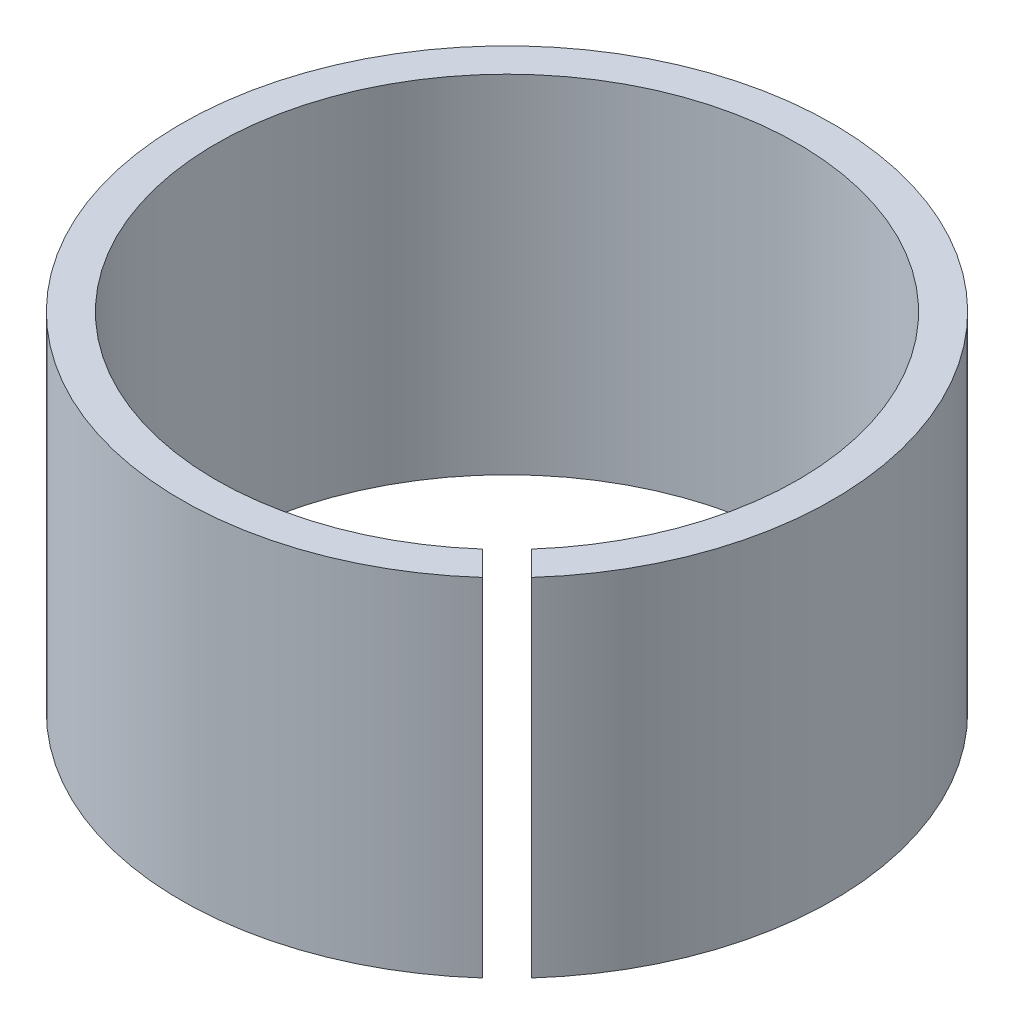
from build123d import *

# Parameters (mm, degrees)
EXTRUSION1_DEPTH = 10


with BuildPart() as part:
    # Esquisse1 → Extrusion1 (new body)
    with BuildSketch(Plane(origin=(0, 0, 0), x_dir=(1, 0, 0), z_dir=(0, 1, 0))):
        with BuildLine():
            Line((5.568528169, -6.27563495), (6.276759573, -6.983866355))
            ThreePointArc((6.276759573, -6.983866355), (-6.639732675, 6.639732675), (6.983866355, -6.276759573))
            Line((6.983866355, -6.276759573), (6.27563495, -5.568528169))
            ThreePointArc((6.27563495, -5.568528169), (-5.932625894, 5.932625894), (5.568528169, -6.27563495))
        make_face()
    extrude(amount=EXTRUSION1_DEPTH)


solid = part.part
